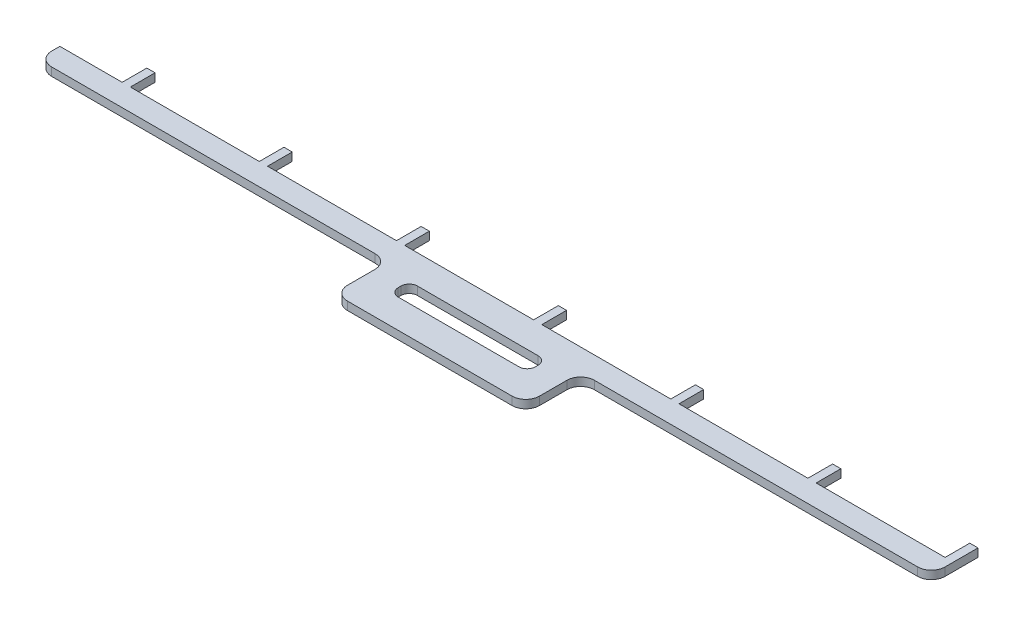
from build123d import *

# Parameters (mm, degrees)
BOSS_EXTRU_1_DEPTH = 3


with BuildPart() as part:
    # Esquisse1 → Boss.-Extru.1 (new body)
    with BuildSketch(Plane(origin=(0, -134, 0), x_dir=(1, 0, 0), z_dir=(0, 1, 0))):
        with BuildLine():
            Line((-150, -2.9), (-150, 6.1))
            Line((-150, 6.1), (-153, 6.1))
            Line((-153, 6.1), (-153, -2.9))
            Line((-153, -2.9), (-175.7, -2.9))
            Line((-175.7, -2.9), (-175.7, -5.9))
            ThreePointArc((-175.7, -5.9), (-174.235533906, -9.435533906), (-170.7, -10.9))
            Line((-170.7, -10.9), (-52.85, -10.9))
            ThreePointArc((-52.85, -10.9), (-49.314466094, -12.364466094), (-47.85, -15.9))
            Line((-47.85, -15.9), (-47.85, -25.9))
            ThreePointArc((-47.85, -25.9), (-46.385533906, -29.435533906), (-42.85, -30.9))
            Line((-42.85, -30.9), (17.15, -30.9))
            ThreePointArc((17.15, -30.9), (20.685533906, -29.435533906), (22.15, -25.9))
            Line((22.15, -25.9), (22.15, -15.9))
            ThreePointArc((22.15, -15.9), (23.614466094, -12.364466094), (27.15, -10.9))
            Line((27.15, -10.9), (145, -10.9))
            ThreePointArc((145, -10.9), (148.535533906, -9.435533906), (150, -5.9))
            Line((150, -5.9), (150, -2.9))
            Line((150, -2.9), (150, 6.1))
            Line((150, 6.1), (147, 6.1))
            Line((147, 6.1), (147, -2.9))
            Line((147, -2.9), (100, -2.9))
            Line((100, -2.9), (100, 6.1))
            Line((100, 6.1), (97, 6.1))
            Line((97, 6.1), (97, -2.9))
            Line((97, -2.9), (50, -2.9))
            Line((50, -2.9), (50, 6.1))
            Line((50, 6.1), (47, 6.1))
            Line((47, 6.1), (47, -2.9))
            Line((47, -2.9), (0, -2.9))
            Line((0, -2.9), (0, 6.1))
            Line((0, 6.1), (-3, 6.1))
            Line((-3, 6.1), (-3, -2.9))
            Line((-3, -2.9), (-50, -2.9))
            Line((-50, -2.9), (-50, 6.1))
            Line((-50, 6.1), (-53, 6.1))
            Line((-53, 6.1), (-53, -2.9))
            Line((-53, -2.9), (-100, -2.9))
            Line((-100, -2.9), (-100, 6.1))
            Line((-100, 6.1), (-103, 6.1))
            Line((-103, 6.1), (-103, -2.9))
            Line((-103, -2.9), (-150, -2.9))
        make_face()
        with BuildLine():
            Line((-34.85, -13.4), (9.15, -13.4))
            ThreePointArc((9.15, -13.4), (11.271320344, -14.278679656), (12.15, -16.4))
            Line((12.15, -16.4), (12.15, -17.4))
            ThreePointArc((12.15, -17.4), (11.271320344, -19.521320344), (9.15, -20.4))
            Line((9.15, -20.4), (-34.85, -20.4))
            ThreePointArc((-34.85, -20.4), (-36.971320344, -19.521320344), (-37.85, -17.4))
            Line((-37.85, -17.4), (-37.85, -16.4))
            ThreePointArc((-37.85, -16.4), (-36.971320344, -14.278679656), (-34.85, -13.4))
        make_face(mode=Mode.SUBTRACT)
    extrude(amount=BOSS_EXTRU_1_DEPTH)


solid = part.part
